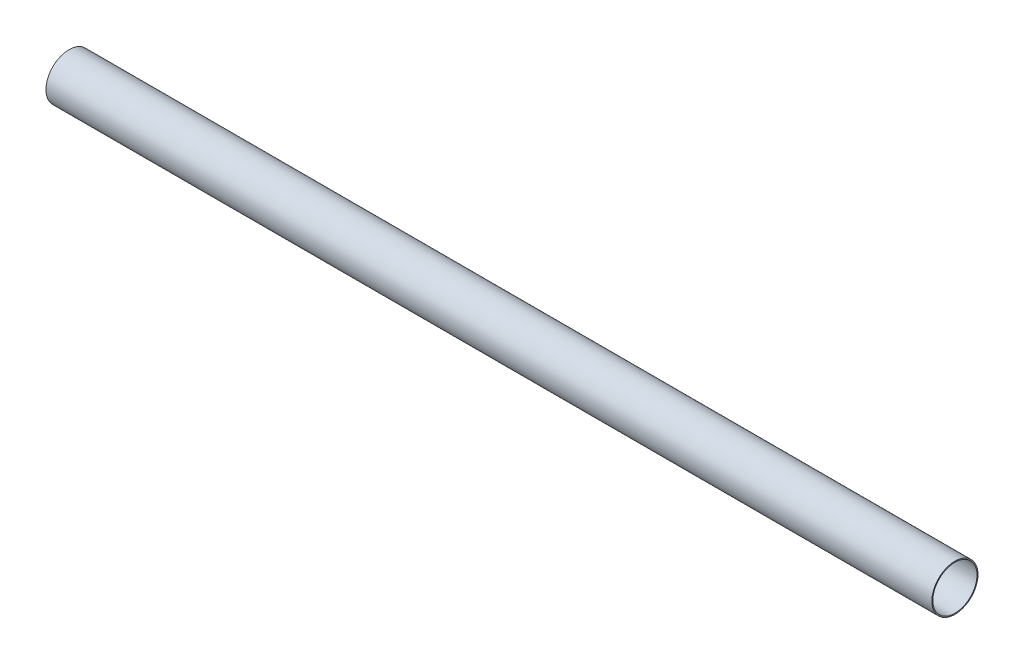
ISO-10303-21;
HEADER;
FILE_DESCRIPTION(('STEP AP214'),'2;1');
FILE_NAME('part.step','',(''),(''),'','','');
FILE_SCHEMA(('AUTOMOTIVE_DESIGN { 1 0 10303 214 1 1 1 1 }'));
ENDSEC;
DATA;
#1=APPLICATION_CONTEXT('core data for automotive mechanical design processes');
#2=APPLICATION_PROTOCOL_DEFINITION('international standard','automotive_design',2000,#1);
#3=PRODUCT_CONTEXT('',#1,'mechanical');
#4=PRODUCT('Part','Part','',(#3));
#5=PRODUCT_RELATED_PRODUCT_CATEGORY('part','',(#4));
#6=PRODUCT_DEFINITION_FORMATION('','',#4);
#7=PRODUCT_DEFINITION_CONTEXT('part definition',#1,'design');
#8=PRODUCT_DEFINITION('design','',#6,#7);
#9=PRODUCT_DEFINITION_SHAPE('','',#8);
#10=(LENGTH_UNIT() NAMED_UNIT(*) SI_UNIT(.MILLI.,.METRE.));
#11=(NAMED_UNIT(*) PLANE_ANGLE_UNIT() SI_UNIT($,.RADIAN.));
#12=(NAMED_UNIT(*) SI_UNIT($,.STERADIAN.) SOLID_ANGLE_UNIT());
#13=UNCERTAINTY_MEASURE_WITH_UNIT(LENGTH_MEASURE(1.E-05),#10,'distance_accuracy_value','');
#14=(GEOMETRIC_REPRESENTATION_CONTEXT(3) GLOBAL_UNCERTAINTY_ASSIGNED_CONTEXT((#13)) GLOBAL_UNIT_ASSIGNED_CONTEXT((#10,
#11,#12)) REPRESENTATION_CONTEXT('',''));
#15=CARTESIAN_POINT('',(0.,0.,0.));
#16=DIRECTION('',(0.,0.,1.));
#17=DIRECTION('',(1.,0.,0.));
#18=AXIS2_PLACEMENT_3D('',#15,#16,#17);
#19=CARTESIAN_POINT('',(-1728.,0.,0.));
#20=DIRECTION('',(1.,0.,0.));
#21=DIRECTION('',(0.,0.,-1.));
#22=AXIS2_PLACEMENT_3D('',#19,#20,#21);
#23=CYLINDRICAL_SURFACE('',#22,45.);
#24=CARTESIAN_POINT('',(-1728.,0.,0.));
#25=DIRECTION('',(1.,0.,0.));
#26=DIRECTION('',(0.,0.,-1.));
#27=AXIS2_PLACEMENT_3D('',#24,#25,#26);
#28=CIRCLE('',#27,45.);
#29=CARTESIAN_POINT('',(-1728.,0.,-45.));
#30=VERTEX_POINT('',#29);
#31=EDGE_CURVE('E10',#30,#30,#28,.T.);
#32=ORIENTED_EDGE('',*,*,#31,.T.);
#33=EDGE_LOOP('',(#32));
#34=FACE_BOUND('',#33,.T.);
#35=CARTESIAN_POINT('',(0.,0.,0.));
#36=DIRECTION('',(1.,0.,0.));
#37=DIRECTION('',(0.,0.,-1.));
#38=AXIS2_PLACEMENT_3D('',#35,#36,#37);
#39=CIRCLE('',#38,45.);
#40=CARTESIAN_POINT('',(0.,0.,-45.));
#41=VERTEX_POINT('',#40);
#42=EDGE_CURVE('E34',#41,#41,#39,.T.);
#43=ORIENTED_EDGE('',*,*,#42,.F.);
#44=EDGE_LOOP('',(#43));
#45=FACE_BOUND('',#44,.T.);
#46=ADVANCED_FACE('F31',(#34,#45),#23,.T.);
#47=CARTESIAN_POINT('',(-1728.,0.,0.));
#48=DIRECTION('',(1.,0.,0.));
#49=DIRECTION('',(0.,0.,-1.));
#50=AXIS2_PLACEMENT_3D('',#47,#48,#49);
#51=PLANE('',#50);
#52=CARTESIAN_POINT('',(-1728.,0.,0.));
#53=DIRECTION('',(1.,0.,0.));
#54=DIRECTION('',(0.,0.,-1.));
#55=AXIS2_PLACEMENT_3D('',#52,#53,#54);
#56=CIRCLE('',#55,43.);
#57=CARTESIAN_POINT('',(-1728.,0.,-43.));
#58=VERTEX_POINT('',#57);
#59=EDGE_CURVE('E41',#58,#58,#56,.T.);
#60=ORIENTED_EDGE('',*,*,#59,.T.);
#61=EDGE_LOOP('',(#60));
#62=FACE_BOUND('',#61,.T.);
#63=ORIENTED_EDGE('',*,*,#31,.F.);
#64=EDGE_LOOP('',(#63));
#65=FACE_BOUND('',#64,.T.);
#66=ADVANCED_FACE('F49',(#62,#65),#51,.F.);
#67=CARTESIAN_POINT('',(0.,0.,0.));
#68=DIRECTION('',(1.,0.,0.));
#69=DIRECTION('',(0.,0.,-1.));
#70=AXIS2_PLACEMENT_3D('',#67,#68,#69);
#71=PLANE('',#70);
#72=CARTESIAN_POINT('',(0.,0.,0.));
#73=DIRECTION('',(1.,0.,0.));
#74=DIRECTION('',(0.,0.,-1.));
#75=AXIS2_PLACEMENT_3D('',#72,#73,#74);
#76=CIRCLE('',#75,43.);
#77=CARTESIAN_POINT('',(0.,0.,-43.));
#78=VERTEX_POINT('',#77);
#79=EDGE_CURVE('E43',#78,#78,#76,.T.);
#80=ORIENTED_EDGE('',*,*,#79,.F.);
#81=EDGE_LOOP('',(#80));
#82=FACE_BOUND('',#81,.T.);
#83=ORIENTED_EDGE('',*,*,#42,.T.);
#84=EDGE_LOOP('',(#83));
#85=FACE_BOUND('',#84,.T.);
#86=ADVANCED_FACE('F55',(#82,#85),#71,.T.);
#87=CARTESIAN_POINT('',(-1728.,0.,0.));
#88=DIRECTION('',(1.,0.,0.));
#89=DIRECTION('',(0.,0.,-1.));
#90=AXIS2_PLACEMENT_3D('',#87,#88,#89);
#91=CYLINDRICAL_SURFACE('',#90,43.);
#92=ORIENTED_EDGE('',*,*,#59,.F.);
#93=EDGE_LOOP('',(#92));
#94=FACE_BOUND('',#93,.T.);
#95=ORIENTED_EDGE('',*,*,#79,.T.);
#96=EDGE_LOOP('',(#95));
#97=FACE_BOUND('',#96,.T.);
#98=ADVANCED_FACE('F52',(#94,#97),#91,.F.);
#99=CLOSED_SHELL('',(#46,#66,#86,#98));
#100=MANIFOLD_SOLID_BREP('B2',#99);
#101=ADVANCED_BREP_SHAPE_REPRESENTATION('',(#18,#100),#14);
#102=SHAPE_DEFINITION_REPRESENTATION(#9,#101);
ENDSEC;
END-ISO-10303-21;
